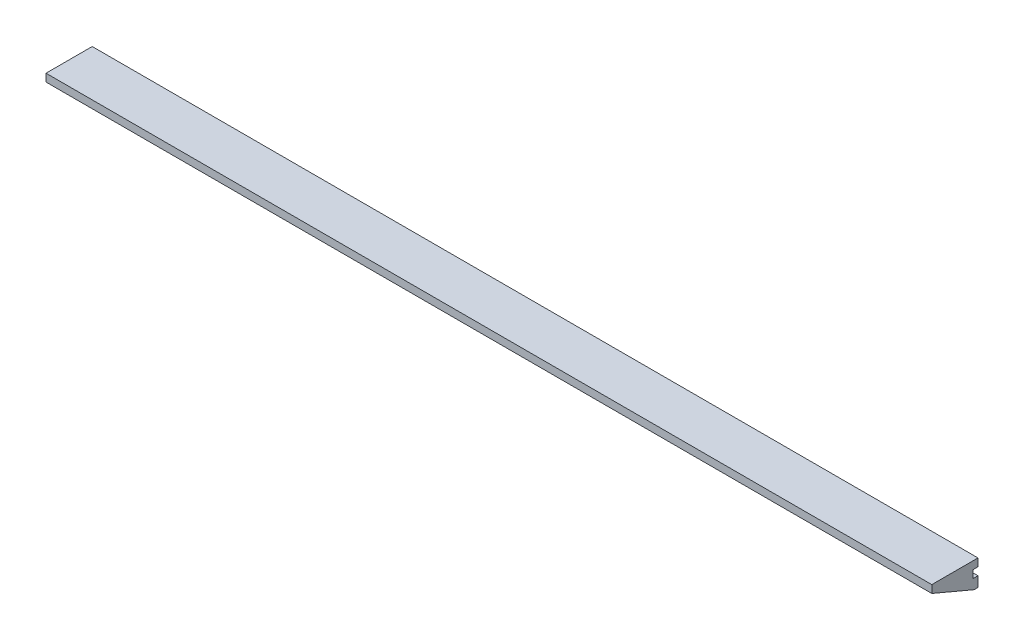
ISO-10303-21;
HEADER;
FILE_DESCRIPTION(('STEP AP214'),'2;1');
FILE_NAME('part.step','',(''),(''),'','','');
FILE_SCHEMA(('AUTOMOTIVE_DESIGN { 1 0 10303 214 1 1 1 1 }'));
ENDSEC;
DATA;
#1=APPLICATION_CONTEXT('core data for automotive mechanical design processes');
#2=APPLICATION_PROTOCOL_DEFINITION('international standard','automotive_design',2000,#1);
#3=PRODUCT_CONTEXT('',#1,'mechanical');
#4=PRODUCT('Part','Part','',(#3));
#5=PRODUCT_RELATED_PRODUCT_CATEGORY('part','',(#4));
#6=PRODUCT_DEFINITION_FORMATION('','',#4);
#7=PRODUCT_DEFINITION_CONTEXT('part definition',#1,'design');
#8=PRODUCT_DEFINITION('design','',#6,#7);
#9=PRODUCT_DEFINITION_SHAPE('','',#8);
#10=(LENGTH_UNIT() NAMED_UNIT(*) SI_UNIT(.MILLI.,.METRE.));
#11=(NAMED_UNIT(*) PLANE_ANGLE_UNIT() SI_UNIT($,.RADIAN.));
#12=(NAMED_UNIT(*) SI_UNIT($,.STERADIAN.) SOLID_ANGLE_UNIT());
#13=UNCERTAINTY_MEASURE_WITH_UNIT(LENGTH_MEASURE(1.E-05),#10,'distance_accuracy_value','');
#14=(GEOMETRIC_REPRESENTATION_CONTEXT(3) GLOBAL_UNCERTAINTY_ASSIGNED_CONTEXT((#13)) GLOBAL_UNIT_ASSIGNED_CONTEXT((#10,
#11,#12)) REPRESENTATION_CONTEXT('',''));
#15=CARTESIAN_POINT('',(0.,0.,0.));
#16=DIRECTION('',(0.,0.,1.));
#17=DIRECTION('',(1.,0.,0.));
#18=AXIS2_PLACEMENT_3D('',#15,#16,#17);
#19=CARTESIAN_POINT('',(365.125,4.2037,-19.05));
#20=DIRECTION('',(0.,0.,1.));
#21=DIRECTION('',(1.,0.,0.));
#22=AXIS2_PLACEMENT_3D('',#19,#20,#21);
#23=PLANE('',#22);
#24=DIRECTION('',(0.,1.,0.));
#25=VECTOR('',#24,1.);
#26=CARTESIAN_POINT('',(-365.125,4.2037,-19.05));
#27=LINE('',#26,#25);
#28=CARTESIAN_POINT('',(-365.125,4.2037,-19.05));
#29=VERTEX_POINT('',#28);
#30=CARTESIAN_POINT('',(-365.125,10.5537,-19.05));
#31=VERTEX_POINT('',#30);
#32=EDGE_CURVE('E135',#29,#31,#27,.T.);
#33=ORIENTED_EDGE('',*,*,#32,.T.);
#34=DIRECTION('',(-1.,0.,0.));
#35=VECTOR('',#34,1.);
#36=CARTESIAN_POINT('',(365.125,10.5537,-19.05));
#37=LINE('',#36,#35);
#38=CARTESIAN_POINT('',(365.125,10.5537,-19.05));
#39=VERTEX_POINT('',#38);
#40=EDGE_CURVE('E11',#39,#31,#37,.T.);
#41=ORIENTED_EDGE('',*,*,#40,.F.);
#42=DIRECTION('',(0.,1.,0.));
#43=VECTOR('',#42,1.);
#44=CARTESIAN_POINT('',(365.125,4.2037,-19.05));
#45=LINE('',#44,#43);
#46=CARTESIAN_POINT('',(365.125,4.2037,-19.05));
#47=VERTEX_POINT('',#46);
#48=EDGE_CURVE('E151',#47,#39,#45,.T.);
#49=ORIENTED_EDGE('',*,*,#48,.F.);
#50=DIRECTION('',(-1.,0.,0.));
#51=VECTOR('',#50,1.);
#52=CARTESIAN_POINT('',(365.125,4.2037,-19.05));
#53=LINE('',#52,#51);
#54=EDGE_CURVE('E131',#47,#29,#53,.T.);
#55=ORIENTED_EDGE('',*,*,#54,.T.);
#56=EDGE_LOOP('',(#33,#41,#49,#55));
#57=FACE_BOUND('',#56,.T.);
#58=ADVANCED_FACE('F33',(#57),#23,.F.);
#59=CARTESIAN_POINT('',(365.125,10.5537,19.05));
#60=DIRECTION('',(0.,-1.,0.));
#61=DIRECTION('',(0.,0.,-1.));
#62=AXIS2_PLACEMENT_3D('',#59,#60,#61);
#63=PLANE('',#62);
#64=DIRECTION('',(0.,0.,1.));
#65=VECTOR('',#64,1.);
#66=CARTESIAN_POINT('',(-365.125,10.5537,19.05));
#67=LINE('',#66,#65);
#68=CARTESIAN_POINT('',(-365.125,10.5537,19.05));
#69=VERTEX_POINT('',#68);
#70=EDGE_CURVE('E138',#31,#69,#67,.T.);
#71=ORIENTED_EDGE('',*,*,#70,.T.);
#72=DIRECTION('',(-1.,0.,0.));
#73=VECTOR('',#72,1.);
#74=CARTESIAN_POINT('',(365.125,10.5537,19.05));
#75=LINE('',#74,#73);
#76=CARTESIAN_POINT('',(365.125,10.5537,19.05));
#77=VERTEX_POINT('',#76);
#78=EDGE_CURVE('E41',#77,#69,#75,.T.);
#79=ORIENTED_EDGE('',*,*,#78,.F.);
#80=DIRECTION('',(0.,0.,1.));
#81=VECTOR('',#80,1.);
#82=CARTESIAN_POINT('',(365.125,10.5537,19.05));
#83=LINE('',#82,#81);
#84=EDGE_CURVE('E95',#39,#77,#83,.T.);
#85=ORIENTED_EDGE('',*,*,#84,.F.);
#86=ORIENTED_EDGE('',*,*,#40,.T.);
#87=EDGE_LOOP('',(#71,#79,#85,#86));
#88=FACE_BOUND('',#87,.T.);
#89=ADVANCED_FACE('F194',(#88),#63,.F.);
#90=CARTESIAN_POINT('',(365.125,4.2037,19.05));
#91=DIRECTION('',(0.,0.,-1.));
#92=DIRECTION('',(-1.,0.,0.));
#93=AXIS2_PLACEMENT_3D('',#90,#91,#92);
#94=PLANE('',#93);
#95=DIRECTION('',(0.,-1.,0.));
#96=VECTOR('',#95,1.);
#97=CARTESIAN_POINT('',(-365.125,4.2037,19.05));
#98=LINE('',#97,#96);
#99=CARTESIAN_POINT('',(-365.125,4.2037,19.05));
#100=VERTEX_POINT('',#99);
#101=EDGE_CURVE('E140',#69,#100,#98,.T.);
#102=ORIENTED_EDGE('',*,*,#101,.T.);
#103=DIRECTION('',(-1.,0.,0.));
#104=VECTOR('',#103,1.);
#105=CARTESIAN_POINT('',(365.125,4.2037,19.05));
#106=LINE('',#105,#104);
#107=CARTESIAN_POINT('',(365.125,4.2037,19.05));
#108=VERTEX_POINT('',#107);
#109=EDGE_CURVE('E161',#108,#100,#106,.T.);
#110=ORIENTED_EDGE('',*,*,#109,.F.);
#111=DIRECTION('',(0.,-1.,0.));
#112=VECTOR('',#111,1.);
#113=CARTESIAN_POINT('',(365.125,4.2037,19.05));
#114=LINE('',#113,#112);
#115=EDGE_CURVE('E169',#77,#108,#114,.T.);
#116=ORIENTED_EDGE('',*,*,#115,.F.);
#117=ORIENTED_EDGE('',*,*,#78,.T.);
#118=EDGE_LOOP('',(#102,#110,#116,#117));
#119=FACE_BOUND('',#118,.T.);
#120=ADVANCED_FACE('F167',(#119),#94,.F.);
#121=CARTESIAN_POINT('',(365.125,4.2037,19.05));
#122=DIRECTION('',(0.,0.921142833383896,-0.389224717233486));
#123=DIRECTION('',(0.,0.389224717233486,0.921142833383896));
#124=AXIS2_PLACEMENT_3D('',#121,#122,#123);
#125=PLANE('',#124);
#126=DIRECTION('',(0.,-0.389224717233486,-0.921142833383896));
#127=VECTOR('',#126,1.);
#128=CARTESIAN_POINT('',(-365.125,4.2037,19.05));
#129=LINE('',#128,#127);
#130=CARTESIAN_POINT('',(-365.125,-10.5537,-15.875));
#131=VERTEX_POINT('',#130);
#132=EDGE_CURVE('E142',#100,#131,#129,.T.);
#133=ORIENTED_EDGE('',*,*,#132,.T.);
#134=DIRECTION('',(-1.,0.,0.));
#135=VECTOR('',#134,1.);
#136=CARTESIAN_POINT('',(365.125,-10.5537,-15.875));
#137=LINE('',#136,#135);
#138=CARTESIAN_POINT('',(365.125,-10.5537,-15.875));
#139=VERTEX_POINT('',#138);
#140=EDGE_CURVE('E158',#139,#131,#137,.T.);
#141=ORIENTED_EDGE('',*,*,#140,.F.);
#142=DIRECTION('',(0.,-0.389224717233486,-0.921142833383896));
#143=VECTOR('',#142,1.);
#144=CARTESIAN_POINT('',(365.125,4.2037,19.05));
#145=LINE('',#144,#143);
#146=EDGE_CURVE('E185',#108,#139,#145,.T.);
#147=ORIENTED_EDGE('',*,*,#146,.F.);
#148=ORIENTED_EDGE('',*,*,#109,.T.);
#149=EDGE_LOOP('',(#133,#141,#147,#148));
#150=FACE_BOUND('',#149,.T.);
#151=ADVANCED_FACE('F178',(#150),#125,.F.);
#152=CARTESIAN_POINT('',(365.125,-10.5537,-15.875));
#153=DIRECTION('',(0.,1.,0.));
#154=DIRECTION('',(0.,0.,1.));
#155=AXIS2_PLACEMENT_3D('',#152,#153,#154);
#156=PLANE('',#155);
#157=DIRECTION('',(0.,0.,-1.));
#158=VECTOR('',#157,1.);
#159=CARTESIAN_POINT('',(-365.125,-10.5537,-15.875));
#160=LINE('',#159,#158);
#161=CARTESIAN_POINT('',(-365.125,-10.5537,-19.05));
#162=VERTEX_POINT('',#161);
#163=EDGE_CURVE('E144',#131,#162,#160,.T.);
#164=ORIENTED_EDGE('',*,*,#163,.T.);
#165=DIRECTION('',(-1.,0.,0.));
#166=VECTOR('',#165,1.);
#167=CARTESIAN_POINT('',(365.125,-10.5537,-19.05));
#168=LINE('',#167,#166);
#169=CARTESIAN_POINT('',(365.125,-10.5537,-19.05));
#170=VERTEX_POINT('',#169);
#171=EDGE_CURVE('E155',#170,#162,#168,.T.);
#172=ORIENTED_EDGE('',*,*,#171,.F.);
#173=DIRECTION('',(0.,0.,-1.));
#174=VECTOR('',#173,1.);
#175=CARTESIAN_POINT('',(365.125,-10.5537,-15.875));
#176=LINE('',#175,#174);
#177=EDGE_CURVE('E184',#139,#170,#176,.T.);
#178=ORIENTED_EDGE('',*,*,#177,.F.);
#179=ORIENTED_EDGE('',*,*,#140,.T.);
#180=EDGE_LOOP('',(#164,#172,#178,#179));
#181=FACE_BOUND('',#180,.T.);
#182=ADVANCED_FACE('F182',(#181),#156,.F.);
#183=CARTESIAN_POINT('',(365.125,-10.5537,-19.05));
#184=DIRECTION('',(0.,0.,1.));
#185=DIRECTION('',(1.,0.,0.));
#186=AXIS2_PLACEMENT_3D('',#183,#184,#185);
#187=PLANE('',#186);
#188=DIRECTION('',(0.,1.,0.));
#189=VECTOR('',#188,1.);
#190=CARTESIAN_POINT('',(-365.125,-10.5537,-19.05));
#191=LINE('',#190,#189);
#192=CARTESIAN_POINT('',(-365.125,-2.1463,-19.05));
#193=VERTEX_POINT('',#192);
#194=EDGE_CURVE('E146',#162,#193,#191,.T.);
#195=ORIENTED_EDGE('',*,*,#194,.T.);
#196=DIRECTION('',(-1.,0.,0.));
#197=VECTOR('',#196,1.);
#198=CARTESIAN_POINT('',(365.125,-2.1463,-19.05));
#199=LINE('',#198,#197);
#200=CARTESIAN_POINT('',(365.125,-2.1463,-19.05));
#201=VERTEX_POINT('',#200);
#202=EDGE_CURVE('E126',#201,#193,#199,.T.);
#203=ORIENTED_EDGE('',*,*,#202,.F.);
#204=DIRECTION('',(0.,1.,0.));
#205=VECTOR('',#204,1.);
#206=CARTESIAN_POINT('',(365.125,-10.5537,-19.05));
#207=LINE('',#206,#205);
#208=EDGE_CURVE('E117',#170,#201,#207,.T.);
#209=ORIENTED_EDGE('',*,*,#208,.F.);
#210=ORIENTED_EDGE('',*,*,#171,.T.);
#211=EDGE_LOOP('',(#195,#203,#209,#210));
#212=FACE_BOUND('',#211,.T.);
#213=ADVANCED_FACE('F206',(#212),#187,.F.);
#214=CARTESIAN_POINT('',(365.125,-2.1463,-19.05));
#215=DIRECTION('',(0.,-1.,0.));
#216=DIRECTION('',(0.,0.,-1.));
#217=AXIS2_PLACEMENT_3D('',#214,#215,#216);
#218=PLANE('',#217);
#219=DIRECTION('',(0.,0.,1.));
#220=VECTOR('',#219,1.);
#221=CARTESIAN_POINT('',(-365.125,-2.1463,-19.05));
#222=LINE('',#221,#220);
#223=CARTESIAN_POINT('',(-365.125,-2.1463,-15.0876));
#224=VERTEX_POINT('',#223);
#225=EDGE_CURVE('E125',#193,#224,#222,.T.);
#226=ORIENTED_EDGE('',*,*,#225,.T.);
#227=DIRECTION('',(-1.,0.,0.));
#228=VECTOR('',#227,1.);
#229=CARTESIAN_POINT('',(365.125,-2.1463,-15.0876));
#230=LINE('',#229,#228);
#231=CARTESIAN_POINT('',(365.125,-2.1463,-15.0876));
#232=VERTEX_POINT('',#231);
#233=EDGE_CURVE('E122',#232,#224,#230,.T.);
#234=ORIENTED_EDGE('',*,*,#233,.F.);
#235=DIRECTION('',(0.,0.,1.));
#236=VECTOR('',#235,1.);
#237=CARTESIAN_POINT('',(365.125,-2.1463,-19.05));
#238=LINE('',#237,#236);
#239=EDGE_CURVE('E111',#201,#232,#238,.T.);
#240=ORIENTED_EDGE('',*,*,#239,.F.);
#241=ORIENTED_EDGE('',*,*,#202,.T.);
#242=EDGE_LOOP('',(#226,#234,#240,#241));
#243=FACE_BOUND('',#242,.T.);
#244=ADVANCED_FACE('F123',(#243),#218,.F.);
#245=CARTESIAN_POINT('',(365.125,4.2037,-15.0876));
#246=DIRECTION('',(0.,0.,1.));
#247=DIRECTION('',(1.,0.,0.));
#248=AXIS2_PLACEMENT_3D('',#245,#246,#247);
#249=PLANE('',#248);
#250=DIRECTION('',(0.,1.,0.));
#251=VECTOR('',#250,1.);
#252=CARTESIAN_POINT('',(-365.125,4.2037,-15.0876));
#253=LINE('',#252,#251);
#254=CARTESIAN_POINT('',(-365.125,4.2037,-15.0876));
#255=VERTEX_POINT('',#254);
#256=EDGE_CURVE('E81',#224,#255,#253,.T.);
#257=ORIENTED_EDGE('',*,*,#256,.T.);
#258=DIRECTION('',(-1.,0.,0.));
#259=VECTOR('',#258,1.);
#260=CARTESIAN_POINT('',(365.125,4.2037,-15.0876));
#261=LINE('',#260,#259);
#262=CARTESIAN_POINT('',(365.125,4.2037,-15.0876));
#263=VERTEX_POINT('',#262);
#264=EDGE_CURVE('E127',#263,#255,#261,.T.);
#265=ORIENTED_EDGE('',*,*,#264,.F.);
#266=DIRECTION('',(0.,1.,0.));
#267=VECTOR('',#266,1.);
#268=CARTESIAN_POINT('',(365.125,4.2037,-15.0876));
#269=LINE('',#268,#267);
#270=EDGE_CURVE('E115',#232,#263,#269,.T.);
#271=ORIENTED_EDGE('',*,*,#270,.F.);
#272=ORIENTED_EDGE('',*,*,#233,.T.);
#273=EDGE_LOOP('',(#257,#265,#271,#272));
#274=FACE_BOUND('',#273,.T.);
#275=ADVANCED_FACE('F129',(#274),#249,.F.);
#276=CARTESIAN_POINT('',(365.125,4.2037,-19.05));
#277=DIRECTION('',(0.,1.,0.));
#278=DIRECTION('',(0.,0.,1.));
#279=AXIS2_PLACEMENT_3D('',#276,#277,#278);
#280=PLANE('',#279);
#281=DIRECTION('',(0.,0.,-1.));
#282=VECTOR('',#281,1.);
#283=CARTESIAN_POINT('',(-365.125,4.2037,-19.05));
#284=LINE('',#283,#282);
#285=EDGE_CURVE('E87',#255,#29,#284,.T.);
#286=ORIENTED_EDGE('',*,*,#285,.T.);
#287=ORIENTED_EDGE('',*,*,#54,.F.);
#288=DIRECTION('',(0.,0.,-1.));
#289=VECTOR('',#288,1.);
#290=CARTESIAN_POINT('',(365.125,4.2037,-19.05));
#291=LINE('',#290,#289);
#292=EDGE_CURVE('E49',#263,#47,#291,.T.);
#293=ORIENTED_EDGE('',*,*,#292,.F.);
#294=ORIENTED_EDGE('',*,*,#264,.T.);
#295=EDGE_LOOP('',(#286,#287,#293,#294));
#296=FACE_BOUND('',#295,.T.);
#297=ADVANCED_FACE('F214',(#296),#280,.F.);
#298=CARTESIAN_POINT('',(365.125,0.,0.));
#299=DIRECTION('',(-1.,0.,0.));
#300=DIRECTION('',(0.,0.,1.));
#301=AXIS2_PLACEMENT_3D('',#298,#299,#300);
#302=PLANE('',#301);
#303=ORIENTED_EDGE('',*,*,#48,.T.);
#304=ORIENTED_EDGE('',*,*,#84,.T.);
#305=ORIENTED_EDGE('',*,*,#115,.T.);
#306=ORIENTED_EDGE('',*,*,#146,.T.);
#307=ORIENTED_EDGE('',*,*,#177,.T.);
#308=ORIENTED_EDGE('',*,*,#208,.T.);
#309=ORIENTED_EDGE('',*,*,#239,.T.);
#310=ORIENTED_EDGE('',*,*,#270,.T.);
#311=ORIENTED_EDGE('',*,*,#292,.T.);
#312=EDGE_LOOP('',(#303,#304,#305,#306,#307,#308,#309,#310,#311));
#313=FACE_BOUND('',#312,.T.);
#314=ADVANCED_FACE('F113',(#313),#302,.F.);
#315=CARTESIAN_POINT('',(-365.125,0.,0.));
#316=DIRECTION('',(-1.,0.,0.));
#317=DIRECTION('',(0.,0.,1.));
#318=AXIS2_PLACEMENT_3D('',#315,#316,#317);
#319=PLANE('',#318);
#320=ORIENTED_EDGE('',*,*,#32,.F.);
#321=ORIENTED_EDGE('',*,*,#285,.F.);
#322=ORIENTED_EDGE('',*,*,#256,.F.);
#323=ORIENTED_EDGE('',*,*,#225,.F.);
#324=ORIENTED_EDGE('',*,*,#194,.F.);
#325=ORIENTED_EDGE('',*,*,#163,.F.);
#326=ORIENTED_EDGE('',*,*,#132,.F.);
#327=ORIENTED_EDGE('',*,*,#101,.F.);
#328=ORIENTED_EDGE('',*,*,#70,.F.);
#329=EDGE_LOOP('',(#320,#321,#322,#323,#324,#325,#326,#327,#328));
#330=FACE_BOUND('',#329,.T.);
#331=ADVANCED_FACE('F173',(#330),#319,.T.);
#332=CLOSED_SHELL('',(#58,#89,#120,#151,#182,#213,#244,#275,#297,#314,#331));
#333=MANIFOLD_SOLID_BREP('B2',#332);
#334=ADVANCED_BREP_SHAPE_REPRESENTATION('',(#18,#333),#14);
#335=SHAPE_DEFINITION_REPRESENTATION(#9,#334);
ENDSEC;
END-ISO-10303-21;
